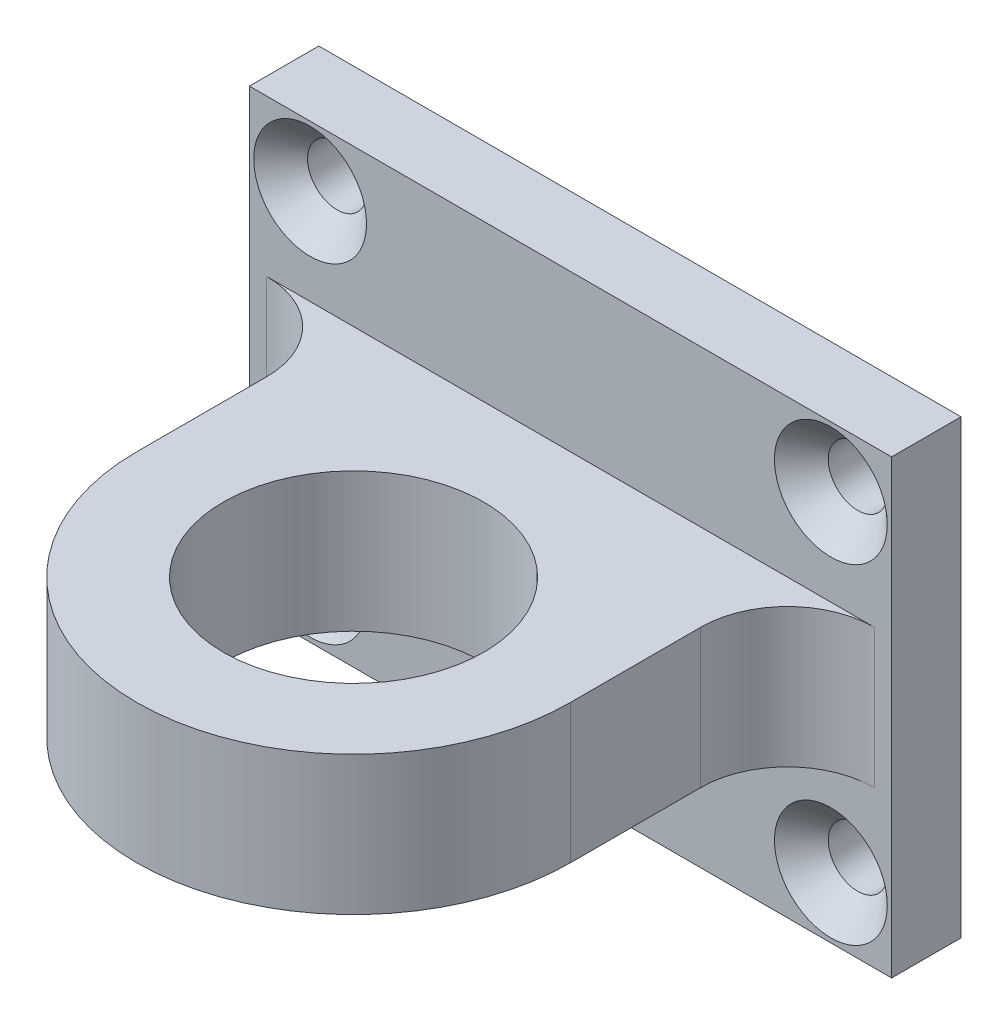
ISO-10303-21;
HEADER;
FILE_DESCRIPTION(('STEP AP214'),'2;1');
FILE_NAME('part.step','',(''),(''),'','','');
FILE_SCHEMA(('AUTOMOTIVE_DESIGN { 1 0 10303 214 1 1 1 1 }'));
ENDSEC;
DATA;
#1=APPLICATION_CONTEXT('core data for automotive mechanical design processes');
#2=APPLICATION_PROTOCOL_DEFINITION('international standard','automotive_design',2000,#1);
#3=PRODUCT_CONTEXT('',#1,'mechanical');
#4=PRODUCT('Part','Part','',(#3));
#5=PRODUCT_RELATED_PRODUCT_CATEGORY('part','',(#4));
#6=PRODUCT_DEFINITION_FORMATION('','',#4);
#7=PRODUCT_DEFINITION_CONTEXT('part definition',#1,'design');
#8=PRODUCT_DEFINITION('design','',#6,#7);
#9=PRODUCT_DEFINITION_SHAPE('','',#8);
#10=(LENGTH_UNIT() NAMED_UNIT(*) SI_UNIT(.MILLI.,.METRE.));
#11=(NAMED_UNIT(*) PLANE_ANGLE_UNIT() SI_UNIT($,.RADIAN.));
#12=(NAMED_UNIT(*) SI_UNIT($,.STERADIAN.) SOLID_ANGLE_UNIT());
#13=UNCERTAINTY_MEASURE_WITH_UNIT(LENGTH_MEASURE(1.E-05),#10,'distance_accuracy_value','');
#14=(GEOMETRIC_REPRESENTATION_CONTEXT(3) GLOBAL_UNCERTAINTY_ASSIGNED_CONTEXT((#13)) GLOBAL_UNIT_ASSIGNED_CONTEXT((#10,
#11,#12)) REPRESENTATION_CONTEXT('',''));
#15=CARTESIAN_POINT('',(0.,0.,0.));
#16=DIRECTION('',(0.,0.,1.));
#17=DIRECTION('',(1.,0.,0.));
#18=AXIS2_PLACEMENT_3D('',#15,#16,#17);
#19=CARTESIAN_POINT('',(-18.5,-13.,4.));
#20=DIRECTION('',(0.,0.,1.));
#21=DIRECTION('',(1.,0.,0.));
#22=AXIS2_PLACEMENT_3D('',#19,#20,#21);
#23=PLANE('',#22);
#24=CARTESIAN_POINT('',(-15.,-9.5,4.));
#25=DIRECTION('',(0.,0.,1.));
#26=DIRECTION('',(1.,0.,0.));
#27=AXIS2_PLACEMENT_3D('',#24,#25,#26);
#28=CIRCLE('',#27,3.25);
#29=CARTESIAN_POINT('',(-11.75,-9.5,4.));
#30=VERTEX_POINT('',#29);
#31=EDGE_CURVE('E238',#30,#30,#28,.T.);
#32=ORIENTED_EDGE('',*,*,#31,.F.);
#33=EDGE_LOOP('',(#32));
#34=FACE_BOUND('',#33,.T.);
#35=CARTESIAN_POINT('',(15.,-9.5,4.));
#36=DIRECTION('',(0.,0.,1.));
#37=DIRECTION('',(1.,0.,0.));
#38=AXIS2_PLACEMENT_3D('',#35,#36,#37);
#39=CIRCLE('',#38,3.25);
#40=CARTESIAN_POINT('',(18.25,-9.5,4.));
#41=VERTEX_POINT('',#40);
#42=EDGE_CURVE('E229',#41,#41,#39,.T.);
#43=ORIENTED_EDGE('',*,*,#42,.F.);
#44=EDGE_LOOP('',(#43));
#45=FACE_BOUND('',#44,.T.);
#46=CARTESIAN_POINT('',(-15.,9.49999999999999,4.));
#47=DIRECTION('',(0.,0.,1.));
#48=DIRECTION('',(1.,0.,0.));
#49=AXIS2_PLACEMENT_3D('',#46,#47,#48);
#50=CIRCLE('',#49,3.25);
#51=CARTESIAN_POINT('',(-11.75,9.49999999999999,4.));
#52=VERTEX_POINT('',#51);
#53=EDGE_CURVE('E220',#52,#52,#50,.T.);
#54=ORIENTED_EDGE('',*,*,#53,.F.);
#55=EDGE_LOOP('',(#54));
#56=FACE_BOUND('',#55,.T.);
#57=CARTESIAN_POINT('',(15.,9.5,4.));
#58=DIRECTION('',(0.,0.,1.));
#59=DIRECTION('',(1.,0.,0.));
#60=AXIS2_PLACEMENT_3D('',#57,#58,#59);
#61=CIRCLE('',#60,3.25);
#62=CARTESIAN_POINT('',(18.25,9.5,4.));
#63=VERTEX_POINT('',#62);
#64=EDGE_CURVE('E211',#63,#63,#61,.T.);
#65=ORIENTED_EDGE('',*,*,#64,.F.);
#66=EDGE_LOOP('',(#65));
#67=FACE_BOUND('',#66,.T.);
#68=DIRECTION('',(0.,-1.,0.));
#69=VECTOR('',#68,1.);
#70=CARTESIAN_POINT('',(-18.5,13.,4.));
#71=LINE('',#70,#69);
#72=CARTESIAN_POINT('',(-18.5,13.,4.));
#73=VERTEX_POINT('',#72);
#74=CARTESIAN_POINT('',(-18.5,-13.,4.));
#75=VERTEX_POINT('',#74);
#76=EDGE_CURVE('E146',#73,#75,#71,.T.);
#77=ORIENTED_EDGE('',*,*,#76,.T.);
#78=DIRECTION('',(1.,0.,0.));
#79=VECTOR('',#78,1.);
#80=CARTESIAN_POINT('',(-18.5,-13.,4.));
#81=LINE('',#80,#79);
#82=CARTESIAN_POINT('',(18.5,-13.,4.));
#83=VERTEX_POINT('',#82);
#84=EDGE_CURVE('E149',#75,#83,#81,.T.);
#85=ORIENTED_EDGE('',*,*,#84,.T.);
#86=DIRECTION('',(0.,1.,0.));
#87=VECTOR('',#86,1.);
#88=CARTESIAN_POINT('',(18.5,13.,4.));
#89=LINE('',#88,#87);
#90=CARTESIAN_POINT('',(18.5,13.,4.));
#91=VERTEX_POINT('',#90);
#92=EDGE_CURVE('E152',#83,#91,#89,.T.);
#93=ORIENTED_EDGE('',*,*,#92,.T.);
#94=DIRECTION('',(-1.,0.,0.));
#95=VECTOR('',#94,1.);
#96=CARTESIAN_POINT('',(-18.5,13.,4.));
#97=LINE('',#96,#95);
#98=EDGE_CURVE('E154',#91,#73,#97,.T.);
#99=ORIENTED_EDGE('',*,*,#98,.T.);
#100=EDGE_LOOP('',(#77,#85,#93,#99));
#101=FACE_BOUND('',#100,.T.);
#102=DIRECTION('',(-1.,0.,0.));
#103=VECTOR('',#102,1.);
#104=CARTESIAN_POINT('',(12.5,-4.,4.));
#105=LINE('',#104,#103);
#106=CARTESIAN_POINT('',(17.5,-4.,4.));
#107=VERTEX_POINT('',#106);
#108=CARTESIAN_POINT('',(-17.5,-4.,4.));
#109=VERTEX_POINT('',#108);
#110=EDGE_CURVE('E123',#107,#109,#105,.T.);
#111=ORIENTED_EDGE('',*,*,#110,.T.);
#112=DIRECTION('',(0.,-1.,0.));
#113=VECTOR('',#112,1.);
#114=CARTESIAN_POINT('',(-17.5,-13.,4.));
#115=LINE('',#114,#113);
#116=CARTESIAN_POINT('',(-17.5,4.,4.00000000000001));
#117=VERTEX_POINT('',#116);
#118=EDGE_CURVE('E177',#109,#117,#115,.F.);
#119=ORIENTED_EDGE('',*,*,#118,.T.);
#120=DIRECTION('',(-1.,0.,0.));
#121=VECTOR('',#120,1.);
#122=CARTESIAN_POINT('',(12.5,4.,4.));
#123=LINE('',#122,#121);
#124=CARTESIAN_POINT('',(17.5,4.,4.));
#125=VERTEX_POINT('',#124);
#126=EDGE_CURVE('E142',#125,#117,#123,.T.);
#127=ORIENTED_EDGE('',*,*,#126,.F.);
#128=DIRECTION('',(0.,-1.,0.));
#129=VECTOR('',#128,1.);
#130=CARTESIAN_POINT('',(17.5,-13.,4.));
#131=LINE('',#130,#129);
#132=EDGE_CURVE('E174',#125,#107,#131,.T.);
#133=ORIENTED_EDGE('',*,*,#132,.T.);
#134=EDGE_LOOP('',(#111,#119,#127,#133));
#135=FACE_BOUND('',#134,.T.);
#136=ADVANCED_FACE('F34',(#34,#45,#56,#67,#101,#135),#23,.T.);
#137=CARTESIAN_POINT('',(-18.5,13.,4.));
#138=DIRECTION('',(1.,0.,0.));
#139=DIRECTION('',(0.,0.,-1.));
#140=AXIS2_PLACEMENT_3D('',#137,#138,#139);
#141=PLANE('',#140);
#142=DIRECTION('',(0.,-1.,0.));
#143=VECTOR('',#142,1.);
#144=CARTESIAN_POINT('',(-18.5,13.,0.));
#145=LINE('',#144,#143);
#146=CARTESIAN_POINT('',(-18.5,13.,0.));
#147=VERTEX_POINT('',#146);
#148=CARTESIAN_POINT('',(-18.5,-13.,0.));
#149=VERTEX_POINT('',#148);
#150=EDGE_CURVE('E137',#147,#149,#145,.T.);
#151=ORIENTED_EDGE('',*,*,#150,.T.);
#152=DIRECTION('',(0.,0.,-1.));
#153=VECTOR('',#152,1.);
#154=CARTESIAN_POINT('',(-18.5,-13.,4.));
#155=LINE('',#154,#153);
#156=EDGE_CURVE('E169',#75,#149,#155,.T.);
#157=ORIENTED_EDGE('',*,*,#156,.F.);
#158=ORIENTED_EDGE('',*,*,#76,.F.);
#159=DIRECTION('',(0.,0.,-1.));
#160=VECTOR('',#159,1.);
#161=CARTESIAN_POINT('',(-18.5,13.,4.));
#162=LINE('',#161,#160);
#163=EDGE_CURVE('E155',#73,#147,#162,.T.);
#164=ORIENTED_EDGE('',*,*,#163,.T.);
#165=EDGE_LOOP('',(#151,#157,#158,#164));
#166=FACE_BOUND('',#165,.T.);
#167=ADVANCED_FACE('F246',(#166),#141,.F.);
#168=CARTESIAN_POINT('',(-18.5,-13.,4.));
#169=DIRECTION('',(0.,1.,0.));
#170=DIRECTION('',(0.,0.,1.));
#171=AXIS2_PLACEMENT_3D('',#168,#169,#170);
#172=PLANE('',#171);
#173=DIRECTION('',(1.,0.,0.));
#174=VECTOR('',#173,1.);
#175=CARTESIAN_POINT('',(-18.5,-13.,0.));
#176=LINE('',#175,#174);
#177=CARTESIAN_POINT('',(18.5,-13.,0.));
#178=VERTEX_POINT('',#177);
#179=EDGE_CURVE('E140',#149,#178,#176,.T.);
#180=ORIENTED_EDGE('',*,*,#179,.T.);
#181=DIRECTION('',(0.,0.,-1.));
#182=VECTOR('',#181,1.);
#183=CARTESIAN_POINT('',(18.5,-13.,4.));
#184=LINE('',#183,#182);
#185=EDGE_CURVE('E166',#83,#178,#184,.T.);
#186=ORIENTED_EDGE('',*,*,#185,.F.);
#187=ORIENTED_EDGE('',*,*,#84,.F.);
#188=ORIENTED_EDGE('',*,*,#156,.T.);
#189=EDGE_LOOP('',(#180,#186,#187,#188));
#190=FACE_BOUND('',#189,.T.);
#191=ADVANCED_FACE('F262',(#190),#172,.F.);
#192=CARTESIAN_POINT('',(18.5,13.,4.));
#193=DIRECTION('',(-1.,0.,0.));
#194=DIRECTION('',(0.,0.,1.));
#195=AXIS2_PLACEMENT_3D('',#192,#193,#194);
#196=PLANE('',#195);
#197=DIRECTION('',(0.,1.,0.));
#198=VECTOR('',#197,1.);
#199=CARTESIAN_POINT('',(18.5,13.,0.));
#200=LINE('',#199,#198);
#201=CARTESIAN_POINT('',(18.5,13.,0.));
#202=VERTEX_POINT('',#201);
#203=EDGE_CURVE('E158',#178,#202,#200,.T.);
#204=ORIENTED_EDGE('',*,*,#203,.T.);
#205=DIRECTION('',(0.,0.,-1.));
#206=VECTOR('',#205,1.);
#207=CARTESIAN_POINT('',(18.5,13.,4.));
#208=LINE('',#207,#206);
#209=EDGE_CURVE('E163',#91,#202,#208,.T.);
#210=ORIENTED_EDGE('',*,*,#209,.F.);
#211=ORIENTED_EDGE('',*,*,#92,.F.);
#212=ORIENTED_EDGE('',*,*,#185,.T.);
#213=EDGE_LOOP('',(#204,#210,#211,#212));
#214=FACE_BOUND('',#213,.T.);
#215=ADVANCED_FACE('F267',(#214),#196,.F.);
#216=CARTESIAN_POINT('',(-18.5,13.,4.));
#217=DIRECTION('',(0.,-1.,0.));
#218=DIRECTION('',(0.,0.,-1.));
#219=AXIS2_PLACEMENT_3D('',#216,#217,#218);
#220=PLANE('',#219);
#221=DIRECTION('',(-1.,0.,0.));
#222=VECTOR('',#221,1.);
#223=CARTESIAN_POINT('',(-18.5,13.,0.));
#224=LINE('',#223,#222);
#225=EDGE_CURVE('E150',#202,#147,#224,.T.);
#226=ORIENTED_EDGE('',*,*,#225,.T.);
#227=ORIENTED_EDGE('',*,*,#163,.F.);
#228=ORIENTED_EDGE('',*,*,#98,.F.);
#229=ORIENTED_EDGE('',*,*,#209,.T.);
#230=EDGE_LOOP('',(#226,#227,#228,#229));
#231=FACE_BOUND('',#230,.T.);
#232=ADVANCED_FACE('F270',(#231),#220,.F.);
#233=CARTESIAN_POINT('',(-18.5,-13.,0.));
#234=DIRECTION('',(0.,0.,1.));
#235=DIRECTION('',(1.,0.,0.));
#236=AXIS2_PLACEMENT_3D('',#233,#234,#235);
#237=PLANE('',#236);
#238=CARTESIAN_POINT('',(-15.,-9.5,0.));
#239=DIRECTION('',(0.,0.,1.));
#240=DIRECTION('',(1.,0.,0.));
#241=AXIS2_PLACEMENT_3D('',#238,#239,#240);
#242=CIRCLE('',#241,1.7);
#243=CARTESIAN_POINT('',(-13.3,-9.5,0.));
#244=VERTEX_POINT('',#243);
#245=EDGE_CURVE('E232',#244,#244,#242,.T.);
#246=ORIENTED_EDGE('',*,*,#245,.T.);
#247=EDGE_LOOP('',(#246));
#248=FACE_BOUND('',#247,.T.);
#249=CARTESIAN_POINT('',(15.,-9.5,0.));
#250=DIRECTION('',(0.,0.,1.));
#251=DIRECTION('',(1.,0.,0.));
#252=AXIS2_PLACEMENT_3D('',#249,#250,#251);
#253=CIRCLE('',#252,1.7);
#254=CARTESIAN_POINT('',(16.7,-9.5,0.));
#255=VERTEX_POINT('',#254);
#256=EDGE_CURVE('E223',#255,#255,#253,.T.);
#257=ORIENTED_EDGE('',*,*,#256,.T.);
#258=EDGE_LOOP('',(#257));
#259=FACE_BOUND('',#258,.T.);
#260=CARTESIAN_POINT('',(-15.,9.49999999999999,0.));
#261=DIRECTION('',(0.,0.,1.));
#262=DIRECTION('',(1.,0.,0.));
#263=AXIS2_PLACEMENT_3D('',#260,#261,#262);
#264=CIRCLE('',#263,1.7);
#265=CARTESIAN_POINT('',(-13.3,9.49999999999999,0.));
#266=VERTEX_POINT('',#265);
#267=EDGE_CURVE('E214',#266,#266,#264,.T.);
#268=ORIENTED_EDGE('',*,*,#267,.T.);
#269=EDGE_LOOP('',(#268));
#270=FACE_BOUND('',#269,.T.);
#271=CARTESIAN_POINT('',(15.,9.5,0.));
#272=DIRECTION('',(0.,0.,1.));
#273=DIRECTION('',(1.,0.,0.));
#274=AXIS2_PLACEMENT_3D('',#271,#272,#273);
#275=CIRCLE('',#274,1.7);
#276=CARTESIAN_POINT('',(16.7,9.5,0.));
#277=VERTEX_POINT('',#276);
#278=EDGE_CURVE('E203',#277,#277,#275,.T.);
#279=ORIENTED_EDGE('',*,*,#278,.T.);
#280=EDGE_LOOP('',(#279));
#281=FACE_BOUND('',#280,.T.);
#282=ORIENTED_EDGE('',*,*,#150,.F.);
#283=ORIENTED_EDGE('',*,*,#225,.F.);
#284=ORIENTED_EDGE('',*,*,#203,.F.);
#285=ORIENTED_EDGE('',*,*,#179,.F.);
#286=EDGE_LOOP('',(#282,#283,#284,#285));
#287=FACE_BOUND('',#286,.T.);
#288=ADVANCED_FACE('F272',(#248,#259,#270,#281,#287),#237,.F.);
#289=CARTESIAN_POINT('',(0.,4.,16.5));
#290=DIRECTION('',(0.,1.,0.));
#291=DIRECTION('',(0.,0.,1.));
#292=AXIS2_PLACEMENT_3D('',#289,#290,#291);
#293=PLANE('',#292);
#294=ORIENTED_EDGE('',*,*,#126,.T.);
#295=CARTESIAN_POINT('',(-17.5,4.,9.));
#296=DIRECTION('',(0.,1.,0.));
#297=DIRECTION('',(0.,0.,1.));
#298=AXIS2_PLACEMENT_3D('',#295,#296,#297);
#299=CIRCLE('',#298,5.);
#300=CARTESIAN_POINT('',(-12.5,4.,9.));
#301=VERTEX_POINT('',#300);
#302=EDGE_CURVE('E118',#117,#301,#299,.F.);
#303=ORIENTED_EDGE('',*,*,#302,.T.);
#304=DIRECTION('',(0.,0.,1.));
#305=VECTOR('',#304,1.);
#306=CARTESIAN_POINT('',(-12.5,4.,4.00000000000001));
#307=LINE('',#306,#305);
#308=CARTESIAN_POINT('',(-12.5,4.,16.5));
#309=VERTEX_POINT('',#308);
#310=EDGE_CURVE('E111',#301,#309,#307,.T.);
#311=ORIENTED_EDGE('',*,*,#310,.T.);
#312=CARTESIAN_POINT('',(0.,4.,16.5));
#313=DIRECTION('',(0.,1.,0.));
#314=DIRECTION('',(0.,0.,1.));
#315=AXIS2_PLACEMENT_3D('',#312,#313,#314);
#316=CIRCLE('',#315,12.5);
#317=CARTESIAN_POINT('',(12.5,4.,16.5));
#318=VERTEX_POINT('',#317);
#319=EDGE_CURVE('E115',#309,#318,#316,.T.);
#320=ORIENTED_EDGE('',*,*,#319,.T.);
#321=DIRECTION('',(0.,0.,-1.));
#322=VECTOR('',#321,1.);
#323=CARTESIAN_POINT('',(12.5,4.,16.5));
#324=LINE('',#323,#322);
#325=CARTESIAN_POINT('',(12.5,4.,9.));
#326=VERTEX_POINT('',#325);
#327=EDGE_CURVE('E131',#318,#326,#324,.T.);
#328=ORIENTED_EDGE('',*,*,#327,.T.);
#329=CARTESIAN_POINT('',(17.5,4.,9.));
#330=DIRECTION('',(0.,1.,0.));
#331=DIRECTION('',(0.,0.,1.));
#332=AXIS2_PLACEMENT_3D('',#329,#330,#331);
#333=CIRCLE('',#332,5.);
#334=EDGE_CURVE('E11',#326,#125,#333,.F.);
#335=ORIENTED_EDGE('',*,*,#334,.T.);
#336=EDGE_LOOP('',(#294,#303,#311,#320,#328,#335));
#337=FACE_BOUND('',#336,.T.);
#338=CARTESIAN_POINT('',(0.,4.,16.5));
#339=DIRECTION('',(0.,1.,0.));
#340=DIRECTION('',(0.,0.,1.));
#341=AXIS2_PLACEMENT_3D('',#338,#339,#340);
#342=CIRCLE('',#341,7.5);
#343=CARTESIAN_POINT('',(0.,4.,24.));
#344=VERTEX_POINT('',#343);
#345=EDGE_CURVE('E197',#344,#344,#342,.T.);
#346=ORIENTED_EDGE('',*,*,#345,.F.);
#347=EDGE_LOOP('',(#346));
#348=FACE_BOUND('',#347,.T.);
#349=ADVANCED_FACE('F113',(#337,#348),#293,.T.);
#350=CARTESIAN_POINT('',(0.,-4.,16.5));
#351=DIRECTION('',(0.,1.,0.));
#352=DIRECTION('',(0.,0.,1.));
#353=AXIS2_PLACEMENT_3D('',#350,#351,#352);
#354=PLANE('',#353);
#355=DIRECTION('',(0.,0.,1.));
#356=VECTOR('',#355,1.);
#357=CARTESIAN_POINT('',(-12.5,-4.,4.00000000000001));
#358=LINE('',#357,#356);
#359=CARTESIAN_POINT('',(-12.5,-4.,9.));
#360=VERTEX_POINT('',#359);
#361=CARTESIAN_POINT('',(-12.5,-4.,16.5));
#362=VERTEX_POINT('',#361);
#363=EDGE_CURVE('E135',#360,#362,#358,.T.);
#364=ORIENTED_EDGE('',*,*,#363,.F.);
#365=CARTESIAN_POINT('',(-17.5,-4.,9.));
#366=DIRECTION('',(0.,1.,0.));
#367=DIRECTION('',(0.,0.,1.));
#368=AXIS2_PLACEMENT_3D('',#365,#366,#367);
#369=CIRCLE('',#368,5.);
#370=EDGE_CURVE('E181',#360,#109,#369,.T.);
#371=ORIENTED_EDGE('',*,*,#370,.T.);
#372=ORIENTED_EDGE('',*,*,#110,.F.);
#373=CARTESIAN_POINT('',(17.5,-4.,9.));
#374=DIRECTION('',(0.,1.,0.));
#375=DIRECTION('',(0.,0.,1.));
#376=AXIS2_PLACEMENT_3D('',#373,#374,#375);
#377=CIRCLE('',#376,5.);
#378=CARTESIAN_POINT('',(12.5,-4.,9.));
#379=VERTEX_POINT('',#378);
#380=EDGE_CURVE('E42',#107,#379,#377,.T.);
#381=ORIENTED_EDGE('',*,*,#380,.T.);
#382=DIRECTION('',(0.,0.,-1.));
#383=VECTOR('',#382,1.);
#384=CARTESIAN_POINT('',(12.5,-4.,16.5));
#385=LINE('',#384,#383);
#386=CARTESIAN_POINT('',(12.5,-4.,16.5));
#387=VERTEX_POINT('',#386);
#388=EDGE_CURVE('E191',#387,#379,#385,.T.);
#389=ORIENTED_EDGE('',*,*,#388,.F.);
#390=CARTESIAN_POINT('',(0.,-4.,16.5));
#391=DIRECTION('',(0.,1.,0.));
#392=DIRECTION('',(0.,0.,1.));
#393=AXIS2_PLACEMENT_3D('',#390,#391,#392);
#394=CIRCLE('',#393,12.5);
#395=EDGE_CURVE('E192',#362,#387,#394,.T.);
#396=ORIENTED_EDGE('',*,*,#395,.F.);
#397=EDGE_LOOP('',(#364,#371,#372,#381,#389,#396));
#398=FACE_BOUND('',#397,.T.);
#399=CARTESIAN_POINT('',(0.,-4.,16.5));
#400=DIRECTION('',(0.,1.,0.));
#401=DIRECTION('',(0.,0.,1.));
#402=AXIS2_PLACEMENT_3D('',#399,#400,#401);
#403=CIRCLE('',#402,7.5);
#404=CARTESIAN_POINT('',(0.,-4.,24.));
#405=VERTEX_POINT('',#404);
#406=EDGE_CURVE('E200',#405,#405,#403,.T.);
#407=ORIENTED_EDGE('',*,*,#406,.T.);
#408=EDGE_LOOP('',(#407));
#409=FACE_BOUND('',#408,.T.);
#410=ADVANCED_FACE('F185',(#398,#409),#354,.F.);
#411=CARTESIAN_POINT('',(-12.5,4.,4.00000000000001));
#412=DIRECTION('',(1.,0.,0.));
#413=DIRECTION('',(0.,0.,-1.));
#414=AXIS2_PLACEMENT_3D('',#411,#412,#413);
#415=PLANE('',#414);
#416=ORIENTED_EDGE('',*,*,#310,.F.);
#417=DIRECTION('',(0.,-1.,0.));
#418=VECTOR('',#417,1.);
#419=CARTESIAN_POINT('',(-12.5,4.,9.));
#420=LINE('',#419,#418);
#421=EDGE_CURVE('E172',#301,#360,#420,.T.);
#422=ORIENTED_EDGE('',*,*,#421,.T.);
#423=ORIENTED_EDGE('',*,*,#363,.T.);
#424=DIRECTION('',(0.,-1.,0.));
#425=VECTOR('',#424,1.);
#426=CARTESIAN_POINT('',(-12.5,4.,16.5));
#427=LINE('',#426,#425);
#428=EDGE_CURVE('E128',#309,#362,#427,.T.);
#429=ORIENTED_EDGE('',*,*,#428,.F.);
#430=EDGE_LOOP('',(#416,#422,#423,#429));
#431=FACE_BOUND('',#430,.T.);
#432=ADVANCED_FACE('F133',(#431),#415,.F.);
#433=CARTESIAN_POINT('',(0.,4.,16.5));
#434=DIRECTION('',(0.,-1.,0.));
#435=DIRECTION('',(0.,0.,-1.));
#436=AXIS2_PLACEMENT_3D('',#433,#434,#435);
#437=CYLINDRICAL_SURFACE('',#436,12.5);
#438=ORIENTED_EDGE('',*,*,#395,.T.);
#439=DIRECTION('',(0.,-1.,0.));
#440=VECTOR('',#439,1.);
#441=CARTESIAN_POINT('',(12.5,4.,16.5));
#442=LINE('',#441,#440);
#443=EDGE_CURVE('E130',#318,#387,#442,.T.);
#444=ORIENTED_EDGE('',*,*,#443,.F.);
#445=ORIENTED_EDGE('',*,*,#319,.F.);
#446=ORIENTED_EDGE('',*,*,#428,.T.);
#447=EDGE_LOOP('',(#438,#444,#445,#446));
#448=FACE_BOUND('',#447,.T.);
#449=ADVANCED_FACE('F127',(#448),#437,.T.);
#450=CARTESIAN_POINT('',(12.5,4.,16.5));
#451=DIRECTION('',(-1.,0.,0.));
#452=DIRECTION('',(0.,0.,1.));
#453=AXIS2_PLACEMENT_3D('',#450,#451,#452);
#454=PLANE('',#453);
#455=ORIENTED_EDGE('',*,*,#388,.T.);
#456=DIRECTION('',(0.,-1.,0.));
#457=VECTOR('',#456,1.);
#458=CARTESIAN_POINT('',(12.5,4.,9.));
#459=LINE('',#458,#457);
#460=EDGE_CURVE('E49',#379,#326,#459,.F.);
#461=ORIENTED_EDGE('',*,*,#460,.T.);
#462=ORIENTED_EDGE('',*,*,#327,.F.);
#463=ORIENTED_EDGE('',*,*,#443,.T.);
#464=EDGE_LOOP('',(#455,#461,#462,#463));
#465=FACE_BOUND('',#464,.T.);
#466=ADVANCED_FACE('F332',(#465),#454,.F.);
#467=CARTESIAN_POINT('',(0.,4.,16.5));
#468=DIRECTION('',(0.,-1.,0.));
#469=DIRECTION('',(0.,0.,-1.));
#470=AXIS2_PLACEMENT_3D('',#467,#468,#469);
#471=CYLINDRICAL_SURFACE('',#470,7.5);
#472=ORIENTED_EDGE('',*,*,#345,.T.);
#473=EDGE_LOOP('',(#472));
#474=FACE_BOUND('',#473,.T.);
#475=ORIENTED_EDGE('',*,*,#406,.F.);
#476=EDGE_LOOP('',(#475));
#477=FACE_BOUND('',#476,.T.);
#478=ADVANCED_FACE('F329',(#474,#477),#471,.F.);
#479=CARTESIAN_POINT('',(15.,9.5,4.));
#480=DIRECTION('',(0.,0.,1.));
#481=DIRECTION('',(1.,0.,0.));
#482=AXIS2_PLACEMENT_3D('',#479,#480,#481);
#483=CYLINDRICAL_SURFACE('',#482,1.7);
#484=ORIENTED_EDGE('',*,*,#278,.F.);
#485=EDGE_LOOP('',(#484));
#486=FACE_BOUND('',#485,.T.);
#487=CARTESIAN_POINT('',(15.,9.5,2.45));
#488=DIRECTION('',(0.,0.,1.));
#489=DIRECTION('',(1.,0.,0.));
#490=AXIS2_PLACEMENT_3D('',#487,#488,#489);
#491=CIRCLE('',#490,1.7);
#492=CARTESIAN_POINT('',(16.7,9.5,2.45));
#493=VERTEX_POINT('',#492);
#494=EDGE_CURVE('E208',#493,#493,#491,.T.);
#495=ORIENTED_EDGE('',*,*,#494,.T.);
#496=EDGE_LOOP('',(#495));
#497=FACE_BOUND('',#496,.T.);
#498=ADVANCED_FACE('F325',(#486,#497),#483,.F.);
#499=CARTESIAN_POINT('',(15.,9.5,4.));
#500=DIRECTION('',(0.,0.,1.));
#501=DIRECTION('',(1.,0.,0.));
#502=AXIS2_PLACEMENT_3D('',#499,#500,#501);
#503=CONICAL_SURFACE('',#502,3.25,0.785398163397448);
#504=ORIENTED_EDGE('',*,*,#494,.F.);
#505=EDGE_LOOP('',(#504));
#506=FACE_BOUND('',#505,.T.);
#507=ORIENTED_EDGE('',*,*,#64,.T.);
#508=EDGE_LOOP('',(#507));
#509=FACE_BOUND('',#508,.T.);
#510=ADVANCED_FACE('F321',(#506,#509),#503,.F.);
#511=CARTESIAN_POINT('',(-15.,9.49999999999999,4.));
#512=DIRECTION('',(0.,0.,1.));
#513=DIRECTION('',(1.,0.,0.));
#514=AXIS2_PLACEMENT_3D('',#511,#512,#513);
#515=CYLINDRICAL_SURFACE('',#514,1.7);
#516=ORIENTED_EDGE('',*,*,#267,.F.);
#517=EDGE_LOOP('',(#516));
#518=FACE_BOUND('',#517,.T.);
#519=CARTESIAN_POINT('',(-15.,9.49999999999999,2.45));
#520=DIRECTION('',(0.,0.,1.));
#521=DIRECTION('',(1.,0.,0.));
#522=AXIS2_PLACEMENT_3D('',#519,#520,#521);
#523=CIRCLE('',#522,1.7);
#524=CARTESIAN_POINT('',(-13.3,9.49999999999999,2.45));
#525=VERTEX_POINT('',#524);
#526=EDGE_CURVE('E217',#525,#525,#523,.T.);
#527=ORIENTED_EDGE('',*,*,#526,.T.);
#528=EDGE_LOOP('',(#527));
#529=FACE_BOUND('',#528,.T.);
#530=ADVANCED_FACE('F317',(#518,#529),#515,.F.);
#531=CARTESIAN_POINT('',(-15.,9.49999999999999,4.));
#532=DIRECTION('',(0.,0.,1.));
#533=DIRECTION('',(1.,0.,0.));
#534=AXIS2_PLACEMENT_3D('',#531,#532,#533);
#535=CONICAL_SURFACE('',#534,3.25,0.785398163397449);
#536=ORIENTED_EDGE('',*,*,#526,.F.);
#537=EDGE_LOOP('',(#536));
#538=FACE_BOUND('',#537,.T.);
#539=ORIENTED_EDGE('',*,*,#53,.T.);
#540=EDGE_LOOP('',(#539));
#541=FACE_BOUND('',#540,.T.);
#542=ADVANCED_FACE('F313',(#538,#541),#535,.F.);
#543=CARTESIAN_POINT('',(15.,-9.5,4.));
#544=DIRECTION('',(0.,0.,1.));
#545=DIRECTION('',(1.,0.,0.));
#546=AXIS2_PLACEMENT_3D('',#543,#544,#545);
#547=CYLINDRICAL_SURFACE('',#546,1.7);
#548=ORIENTED_EDGE('',*,*,#256,.F.);
#549=EDGE_LOOP('',(#548));
#550=FACE_BOUND('',#549,.T.);
#551=CARTESIAN_POINT('',(15.,-9.5,2.45));
#552=DIRECTION('',(0.,0.,1.));
#553=DIRECTION('',(1.,0.,0.));
#554=AXIS2_PLACEMENT_3D('',#551,#552,#553);
#555=CIRCLE('',#554,1.7);
#556=CARTESIAN_POINT('',(16.7,-9.5,2.45));
#557=VERTEX_POINT('',#556);
#558=EDGE_CURVE('E226',#557,#557,#555,.T.);
#559=ORIENTED_EDGE('',*,*,#558,.T.);
#560=EDGE_LOOP('',(#559));
#561=FACE_BOUND('',#560,.T.);
#562=ADVANCED_FACE('F309',(#550,#561),#547,.F.);
#563=CARTESIAN_POINT('',(15.,-9.5,4.));
#564=DIRECTION('',(0.,0.,1.));
#565=DIRECTION('',(1.,0.,0.));
#566=AXIS2_PLACEMENT_3D('',#563,#564,#565);
#567=CONICAL_SURFACE('',#566,3.25,0.785398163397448);
#568=ORIENTED_EDGE('',*,*,#558,.F.);
#569=EDGE_LOOP('',(#568));
#570=FACE_BOUND('',#569,.T.);
#571=ORIENTED_EDGE('',*,*,#42,.T.);
#572=EDGE_LOOP('',(#571));
#573=FACE_BOUND('',#572,.T.);
#574=ADVANCED_FACE('F302',(#570,#573),#567,.F.);
#575=CARTESIAN_POINT('',(-15.,-9.5,4.));
#576=DIRECTION('',(0.,0.,1.));
#577=DIRECTION('',(1.,0.,0.));
#578=AXIS2_PLACEMENT_3D('',#575,#576,#577);
#579=CYLINDRICAL_SURFACE('',#578,1.7);
#580=ORIENTED_EDGE('',*,*,#245,.F.);
#581=EDGE_LOOP('',(#580));
#582=FACE_BOUND('',#581,.T.);
#583=CARTESIAN_POINT('',(-15.,-9.5,2.45));
#584=DIRECTION('',(0.,0.,1.));
#585=DIRECTION('',(1.,0.,0.));
#586=AXIS2_PLACEMENT_3D('',#583,#584,#585);
#587=CIRCLE('',#586,1.7);
#588=CARTESIAN_POINT('',(-13.3,-9.5,2.45));
#589=VERTEX_POINT('',#588);
#590=EDGE_CURVE('E235',#589,#589,#587,.T.);
#591=ORIENTED_EDGE('',*,*,#590,.T.);
#592=EDGE_LOOP('',(#591));
#593=FACE_BOUND('',#592,.T.);
#594=ADVANCED_FACE('F296',(#582,#593),#579,.F.);
#595=CARTESIAN_POINT('',(-15.,-9.5,4.));
#596=DIRECTION('',(0.,0.,1.));
#597=DIRECTION('',(1.,0.,0.));
#598=AXIS2_PLACEMENT_3D('',#595,#596,#597);
#599=CONICAL_SURFACE('',#598,3.25,0.785398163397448);
#600=ORIENTED_EDGE('',*,*,#590,.F.);
#601=EDGE_LOOP('',(#600));
#602=FACE_BOUND('',#601,.T.);
#603=ORIENTED_EDGE('',*,*,#31,.T.);
#604=EDGE_LOOP('',(#603));
#605=FACE_BOUND('',#604,.T.);
#606=ADVANCED_FACE('F242',(#602,#605),#599,.F.);
#607=CARTESIAN_POINT('',(-17.5,4.,9.));
#608=DIRECTION('',(0.,-1.,0.));
#609=DIRECTION('',(0.,0.,-1.));
#610=AXIS2_PLACEMENT_3D('',#607,#608,#609);
#611=CYLINDRICAL_SURFACE('',#610,5.);
#612=ORIENTED_EDGE('',*,*,#302,.F.);
#613=ORIENTED_EDGE('',*,*,#118,.F.);
#614=ORIENTED_EDGE('',*,*,#370,.F.);
#615=ORIENTED_EDGE('',*,*,#421,.F.);
#616=EDGE_LOOP('',(#612,#613,#614,#615));
#617=FACE_BOUND('',#616,.T.);
#618=ADVANCED_FACE('F188',(#617),#611,.F.);
#619=CARTESIAN_POINT('',(17.5,-13.,9.));
#620=DIRECTION('',(0.,-1.,0.));
#621=DIRECTION('',(0.,0.,-1.));
#622=AXIS2_PLACEMENT_3D('',#619,#620,#621);
#623=CYLINDRICAL_SURFACE('',#622,5.);
#624=ORIENTED_EDGE('',*,*,#334,.F.);
#625=ORIENTED_EDGE('',*,*,#460,.F.);
#626=ORIENTED_EDGE('',*,*,#380,.F.);
#627=ORIENTED_EDGE('',*,*,#132,.F.);
#628=EDGE_LOOP('',(#624,#625,#626,#627));
#629=FACE_BOUND('',#628,.T.);
#630=ADVANCED_FACE('F36',(#629),#623,.F.);
#631=CLOSED_SHELL('',(#136,#167,#191,#215,#232,#288,#349,#410,#432,#449,#466,#478,#498,#510,
#530,#542,#562,#574,#594,#606,#618,#630));
#632=MANIFOLD_SOLID_BREP('B2',#631);
#633=ADVANCED_BREP_SHAPE_REPRESENTATION('',(#18,#632),#14);
#634=SHAPE_DEFINITION_REPRESENTATION(#9,#633);
ENDSEC;
END-ISO-10303-21;
